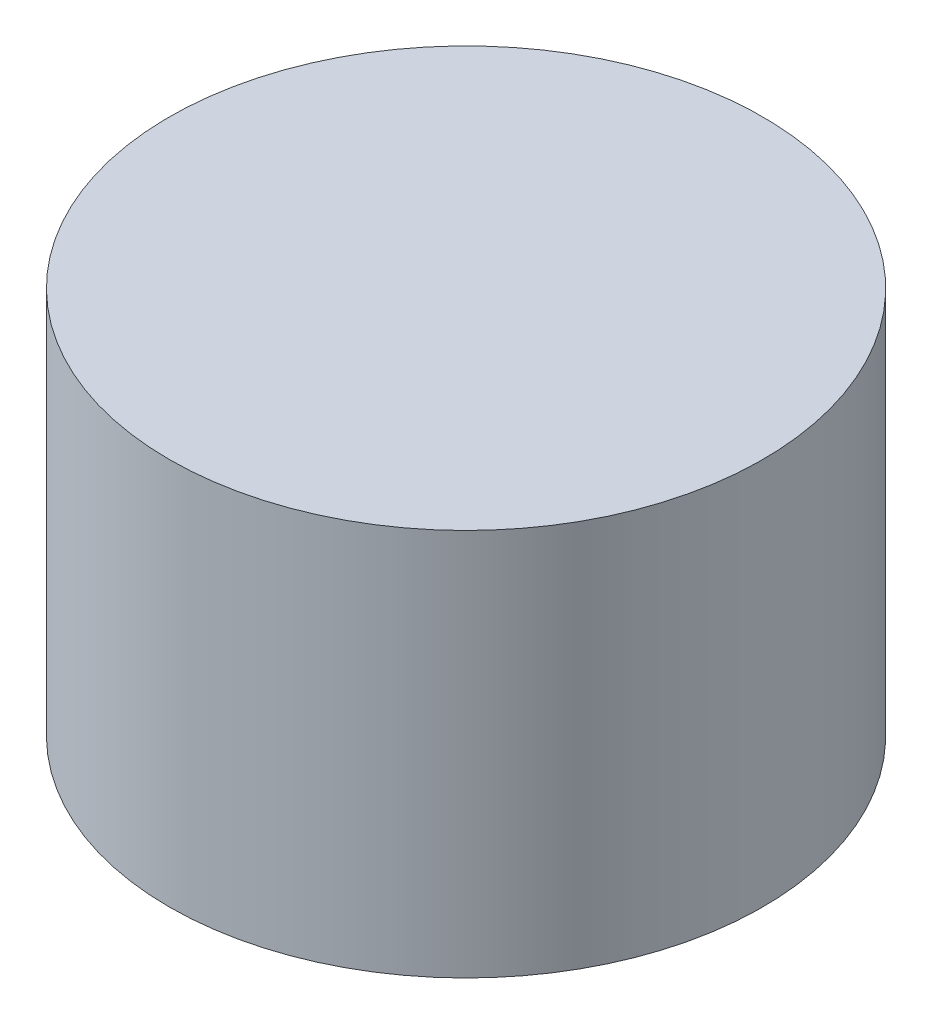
ISO-10303-21;
HEADER;
FILE_DESCRIPTION(('STEP AP214'),'2;1');
FILE_NAME('part.step','',(''),(''),'','','');
FILE_SCHEMA(('AUTOMOTIVE_DESIGN { 1 0 10303 214 1 1 1 1 }'));
ENDSEC;
DATA;
#1=APPLICATION_CONTEXT('core data for automotive mechanical design processes');
#2=APPLICATION_PROTOCOL_DEFINITION('international standard','automotive_design',2000,#1);
#3=PRODUCT_CONTEXT('',#1,'mechanical');
#4=PRODUCT('Part','Part','',(#3));
#5=PRODUCT_RELATED_PRODUCT_CATEGORY('part','',(#4));
#6=PRODUCT_DEFINITION_FORMATION('','',#4);
#7=PRODUCT_DEFINITION_CONTEXT('part definition',#1,'design');
#8=PRODUCT_DEFINITION('design','',#6,#7);
#9=PRODUCT_DEFINITION_SHAPE('','',#8);
#10=(LENGTH_UNIT() NAMED_UNIT(*) SI_UNIT(.MILLI.,.METRE.));
#11=(NAMED_UNIT(*) PLANE_ANGLE_UNIT() SI_UNIT($,.RADIAN.));
#12=(NAMED_UNIT(*) SI_UNIT($,.STERADIAN.) SOLID_ANGLE_UNIT());
#13=UNCERTAINTY_MEASURE_WITH_UNIT(LENGTH_MEASURE(1.E-05),#10,'distance_accuracy_value','');
#14=(GEOMETRIC_REPRESENTATION_CONTEXT(3) GLOBAL_UNCERTAINTY_ASSIGNED_CONTEXT((#13)) GLOBAL_UNIT_ASSIGNED_CONTEXT((#10,
#11,#12)) REPRESENTATION_CONTEXT('',''));
#15=CARTESIAN_POINT('',(0.,0.,0.));
#16=DIRECTION('',(0.,0.,1.));
#17=DIRECTION('',(1.,0.,0.));
#18=AXIS2_PLACEMENT_3D('',#15,#16,#17);
#19=CARTESIAN_POINT('',(0.,64.,0.));
#20=DIRECTION('',(0.,-1.,0.));
#21=DIRECTION('',(0.,0.,-1.));
#22=AXIS2_PLACEMENT_3D('',#19,#20,#21);
#23=CYLINDRICAL_SURFACE('',#22,49.);
#24=CARTESIAN_POINT('',(0.,64.,0.));
#25=DIRECTION('',(0.,1.,0.));
#26=DIRECTION('',(0.,0.,1.));
#27=AXIS2_PLACEMENT_3D('',#24,#25,#26);
#28=CIRCLE('',#27,49.);
#29=CARTESIAN_POINT('',(0.,64.,49.));
#30=VERTEX_POINT('',#29);
#31=EDGE_CURVE('E10',#30,#30,#28,.T.);
#32=ORIENTED_EDGE('',*,*,#31,.F.);
#33=EDGE_LOOP('',(#32));
#34=FACE_BOUND('',#33,.T.);
#35=CARTESIAN_POINT('',(0.,0.,0.));
#36=DIRECTION('',(0.,1.,0.));
#37=DIRECTION('',(0.,0.,1.));
#38=AXIS2_PLACEMENT_3D('',#35,#36,#37);
#39=CIRCLE('',#38,49.);
#40=CARTESIAN_POINT('',(0.,0.,49.));
#41=VERTEX_POINT('',#40);
#42=EDGE_CURVE('E40',#41,#41,#39,.T.);
#43=ORIENTED_EDGE('',*,*,#42,.T.);
#44=EDGE_LOOP('',(#43));
#45=FACE_BOUND('',#44,.T.);
#46=ADVANCED_FACE('F37',(#34,#45),#23,.T.);
#47=CARTESIAN_POINT('',(0.,64.,0.));
#48=DIRECTION('',(0.,1.,0.));
#49=DIRECTION('',(0.,0.,1.));
#50=AXIS2_PLACEMENT_3D('',#47,#48,#49);
#51=PLANE('',#50);
#52=ORIENTED_EDGE('',*,*,#31,.T.);
#53=EDGE_LOOP('',(#52));
#54=FACE_BOUND('',#53,.T.);
#55=ADVANCED_FACE('F72',(#54),#51,.T.);
#56=CARTESIAN_POINT('',(0.,0.,0.));
#57=DIRECTION('',(0.,1.,0.));
#58=DIRECTION('',(0.,0.,1.));
#59=AXIS2_PLACEMENT_3D('',#56,#57,#58);
#60=PLANE('',#59);
#61=ORIENTED_EDGE('',*,*,#42,.F.);
#62=EDGE_LOOP('',(#61));
#63=FACE_BOUND('',#62,.T.);
#64=ADVANCED_FACE('F74',(#63),#60,.F.);
#65=CLOSED_SHELL('',(#46,#55,#64));
#66=CARTESIAN_POINT('',(0.,47.5,0.));
#67=DIRECTION('',(0.,-1.,0.));
#68=DIRECTION('',(0.,0.,-1.));
#69=AXIS2_PLACEMENT_3D('',#66,#67,#68);
#70=CYLINDRICAL_SURFACE('',#69,35.);
#71=CARTESIAN_POINT('',(0.,47.5,0.));
#72=DIRECTION('',(0.,1.,0.));
#73=DIRECTION('',(0.,0.,1.));
#74=AXIS2_PLACEMENT_3D('',#71,#72,#73);
#75=CIRCLE('',#74,35.);
#76=CARTESIAN_POINT('',(0.,47.5,35.));
#77=VERTEX_POINT('',#76);
#78=EDGE_CURVE('E47',#77,#77,#75,.T.);
#79=ORIENTED_EDGE('',*,*,#78,.T.);
#80=EDGE_LOOP('',(#79));
#81=FACE_BOUND('',#80,.T.);
#82=CARTESIAN_POINT('',(0.,16.5,0.));
#83=DIRECTION('',(0.,1.,0.));
#84=DIRECTION('',(0.,0.,1.));
#85=AXIS2_PLACEMENT_3D('',#82,#83,#84);
#86=CIRCLE('',#85,35.);
#87=CARTESIAN_POINT('',(0.,16.5,35.));
#88=VERTEX_POINT('',#87);
#89=EDGE_CURVE('E49',#88,#88,#86,.T.);
#90=ORIENTED_EDGE('',*,*,#89,.F.);
#91=EDGE_LOOP('',(#90));
#92=FACE_BOUND('',#91,.T.);
#93=ADVANCED_FACE('F55',(#81,#92),#70,.F.);
#94=CARTESIAN_POINT('',(0.,47.5,0.));
#95=DIRECTION('',(0.,1.,0.));
#96=DIRECTION('',(0.,0.,1.));
#97=AXIS2_PLACEMENT_3D('',#94,#95,#96);
#98=PLANE('',#97);
#99=ORIENTED_EDGE('',*,*,#78,.F.);
#100=EDGE_LOOP('',(#99));
#101=FACE_BOUND('',#100,.T.);
#102=ADVANCED_FACE('F58',(#101),#98,.F.);
#103=CARTESIAN_POINT('',(0.,16.5,0.));
#104=DIRECTION('',(0.,1.,0.));
#105=DIRECTION('',(0.,0.,1.));
#106=AXIS2_PLACEMENT_3D('',#103,#104,#105);
#107=PLANE('',#106);
#108=ORIENTED_EDGE('',*,*,#89,.T.);
#109=EDGE_LOOP('',(#108));
#110=FACE_BOUND('',#109,.T.);
#111=ADVANCED_FACE('F60',(#110),#107,.T.);
#112=CLOSED_SHELL('',(#93,#102,#111));
#113=ORIENTED_CLOSED_SHELL('',*,#112,.T.);
#114=BREP_WITH_VOIDS('B2',#65,(#113));
#115=ADVANCED_BREP_SHAPE_REPRESENTATION('',(#18,#114),#14);
#116=SHAPE_DEFINITION_REPRESENTATION(#9,#115);
ENDSEC;
END-ISO-10303-21;
